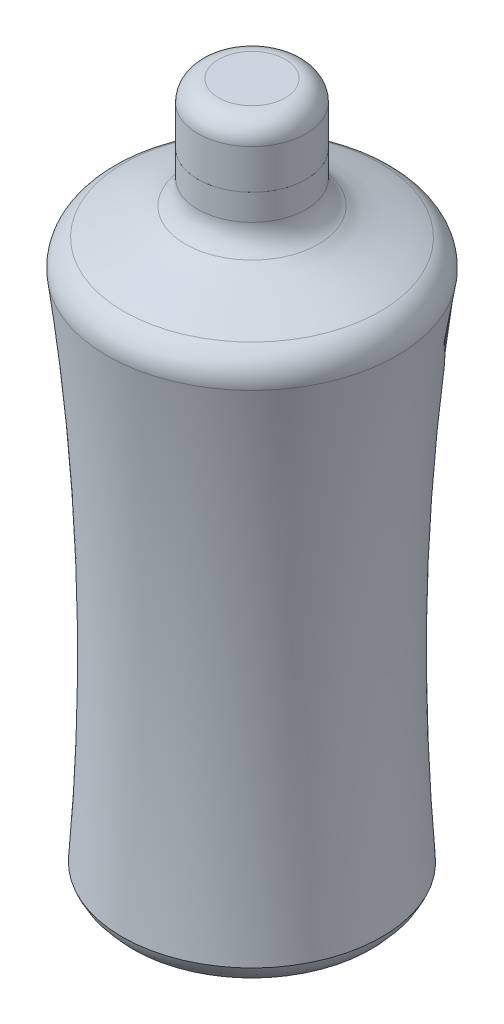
from build123d import *

# Parameters (mm, degrees)
SHELL1_T = -0.508


with BuildPart() as part:
    # Sketch1 → Revolve1 (revolve)
    with BuildSketch(Plane.XY, mode=Mode.PRIVATE) as revolve1_sk:
        with BuildLine():
            Line((0, 11.324800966), (40.719666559, 11.324800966))
            ThreePointArc((40.719666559, 11.324800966), (46.696786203, 9.998996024), (51.552743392, 6.270269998))
            ThreePointArc((51.552743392, 6.270269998), (58.956653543, 1.944564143), (67.42211238, 3.310442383))
            ThreePointArc((67.42211238, 3.310442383), (74.627609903, 9.130002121), (79.399774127, 17.068069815))
            add(Edge.make_bspline(
                [(79.399774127, 17.068069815), (71.962670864, 121.48837333), (75.03768611, 225.653277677), (88.620527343, 329.428470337)],
                knots=[0, 0, 0, 0, 0.9603517, 0.9603517, 0.9603517, 0.9603517], degree=3))
            ThreePointArc((88.620527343, 329.428470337), (86.566774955, 340.310367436), (78.4707759, 347.866052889))
            add(Edge.make_bspline(
                [(78.4707759, 347.866052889), (67.406014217, 352.997027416), (47.766669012, 358.994002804), (41.976224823, 363.708135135), (40.719666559, 364.581078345)],
                knots=[0.136476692, 0.136476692, 0.136476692, 0.136476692, 0.51691406, 0.609088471, 0.609088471, 0.609088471, 0.609088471], degree=3))
            ThreePointArc((40.719666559, 364.581078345), (35.108074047, 370.944179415), (33.083916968, 379.183221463))
            Line((33.083916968, 379.183221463), (33.083916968, 395.100887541))
            Line((33.083916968, 395.100887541), (0, 395.100887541))
            Line((0, 395.100887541), (0, 373.762055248))
            Line((0, 373.762055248), (0, 11.324800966))
        make_face()
    revolve(revolve1_sk.sketch.rotate(Axis((0, 395.100887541, 0), (0, -1, 0)), 90), axis=Axis((0, 395.100887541, 0), (0, -1, 0)))

    # Shell1
    shell1_openings = [part.faces().sort_by_distance(p)[0] for p in [
        (0, 395.100887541, 0),
    ]]
    offset(amount=SHELL1_T, openings=shell1_openings, kind=Kind.INTERSECTION)


with BuildPart() as body_2:
    # Sketch3 → Revolve2 (revolve)
    with BuildSketch(Plane.XY, mode=Mode.PRIVATE) as revolve2_sk:
        with BuildLine():
            Line((0, 395.100887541), (33.065750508, 395.100887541))
            Line((33.065750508, 395.100887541), (33.065750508, 419.242700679))
            ThreePointArc((33.065750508, 419.242700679), (29.346006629, 428.2229568), (20.365750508, 431.942700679))
            Line((20.365750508, 431.942700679), (0, 431.942700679))
            Line((0, 431.942700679), (0, 395.100887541))
        make_face()
    revolve(revolve2_sk.sketch.rotate(Axis((0, 431.942700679, 0), (0, -1, 0)), 90), axis=Axis((0, 431.942700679, 0), (0, -1, 0)))


solid = Compound([part.part, body_2.part])
